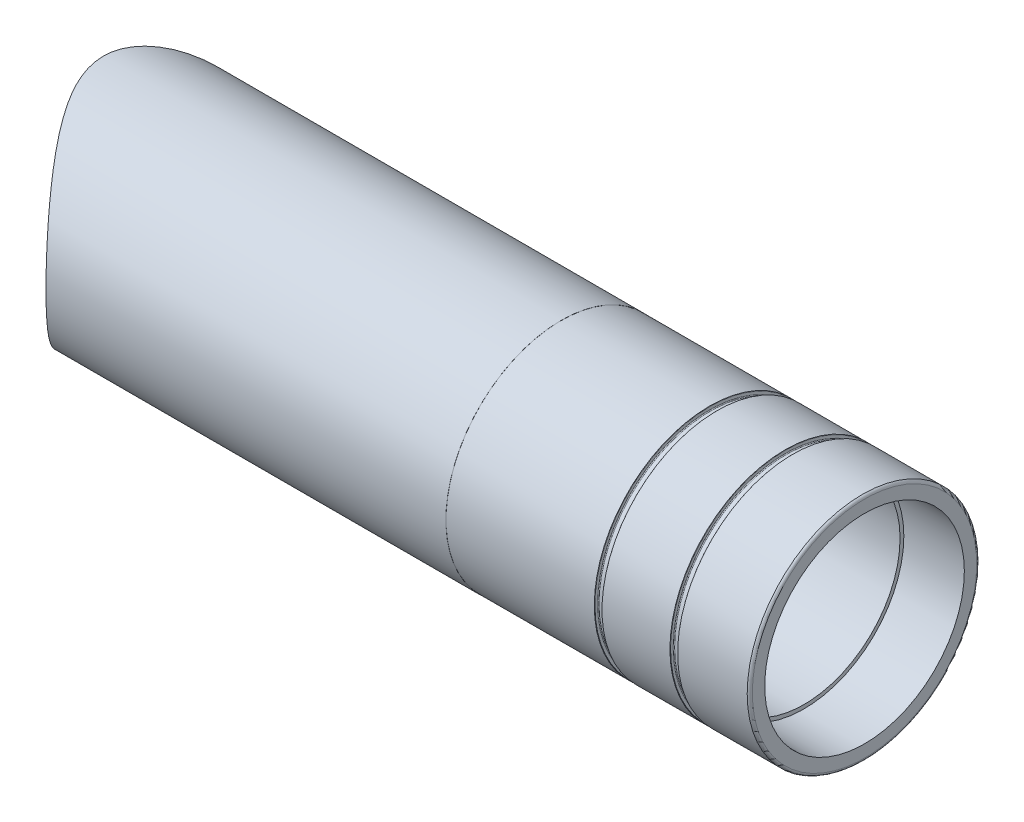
from build123d import *

# Parameters (mm, degrees)
BOSS_EXTRUDE1_DEPTH            = 130
BOSS_EXTRUDE1_DEPTH_BACK       = 150
SKETCH1_R                      = 38.1
SKETCH1_R_2                    = 31.75
CUT_EXTRUDE1_REACH             = 161.384
SKETCH2_R                      = 47.5
CUT_EXTRUDE1_DIRECTION_2_REACH = 161.384
FILLET1_R                      = 1
FILLET2_R                      = 0.1778
SKETCH6_R                      = 33
CUT_EXTRUDE2_DEPTH             = 70
CUT_EXTRUDE4_START             = -20
SKETCH8_R                      = 33
CUT_EXTRUDE4_DEPTH             = 20
SKETCH9_OUTSIDE_W              = 132.948
SKETCH9_OUTSIDE_H              = 132.948
SKETCH9_OUTSIDE_R              = 38.0615
CUT_EXTRUDE5_DEPTH             = 100.3


with BuildPart() as part:
    # Sketch1 → Boss-Extrude1 (new, two sides: drawn at the far end of the back side and taken through both)
    with BuildSketch(Plane(origin=(0, 0, 0), x_dir=(0, 0, -1), z_dir=(1, 0, 0)).offset(-BOSS_EXTRUDE1_DEPTH_BACK)):
        Circle(SKETCH1_R)
        Circle(SKETCH1_R_2, mode=Mode.SUBTRACT)
    extrude(amount=BOSS_EXTRUDE1_DEPTH + BOSS_EXTRUDE1_DEPTH_BACK)

    # Sketch2 → Cut-Extrude1 (cut, up to next)
    with BuildSketch(Plane.XY, mode=Mode.PRIVATE) as cut_extrude1_sk1:
        with Locations((-150, 0)):
            Circle(SKETCH2_R)
    cut_extrude1_tool1 = extrude(cut_extrude1_sk1.sketch, amount=-CUT_EXTRUDE1_REACH, mode=Mode.PRIVATE) & part.part
    add(cut_extrude1_tool1.solids().sort_by_distance((-150, 0, 0))[0], mode=Mode.SUBTRACT)

    # Sketch2 → Cut-Extrude1 direction 2 (cut, up to next)
    with BuildSketch(Plane.XY, mode=Mode.PRIVATE) as cut_extrude1_direction_2_sk1:
        with Locations((-150, 0)):
            Circle(SKETCH2_R)
    cut_extrude1_direction_2_tool1 = extrude(cut_extrude1_direction_2_sk1.sketch, amount=CUT_EXTRUDE1_DIRECTION_2_REACH, mode=Mode.PRIVATE) & part.part
    add(cut_extrude1_direction_2_tool1.solids().sort_by_distance((-150, 0, 0))[0], mode=Mode.SUBTRACT)

    # Fillet1
    fillet1_edges = [part.edges().sort_by_distance(p)[0] for p in [
        (130, 0, 38.1),
    ]]
    fillet(fillet1_edges, radius=FILLET1_R)

    # Sketch5 → Cut-Revolve1 (revolve, cut)
    with BuildSketch(Plane.XY, mode=Mode.PRIVATE) as cut_revolve1_sk:
        with BuildLine():
            Line((103.7935, 39.3825), (106.2065, 39.3825))
            Line((106.2065, 39.3825), (106.2065, 37.0715))
            ThreePointArc((106.2065, 37.0715), (106.132105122, 36.891894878), (105.9525, 36.8175))
            Line((105.9525, 36.8175), (104.0475, 36.8175))
            ThreePointArc((104.0475, 36.8175), (103.867894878, 36.891894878), (103.7935, 37.0715))
            Line((103.7935, 37.0715), (103.7935, 39.3825))
        make_face()
        with BuildLine():
            Line((78.793515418, 39.354735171), (81.206515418, 39.354735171))
            Line((81.206515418, 39.354735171), (81.206515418, 37.043735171))
            ThreePointArc((81.206515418, 37.043735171), (81.13212054, 36.864130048), (80.952515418, 36.789735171))
            Line((80.952515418, 36.789735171), (79.047515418, 36.789735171))
            ThreePointArc((79.047515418, 36.789735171), (78.867910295, 36.864130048), (78.793515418, 37.043735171))
            Line((78.793515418, 37.043735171), (78.793515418, 39.354735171))
        make_face()
    revolve(cut_revolve1_sk.sketch.rotate(Axis((130, 0, 0), (-1, 0, 0)), 90), axis=Axis((130, 0, 0), (-1, 0, 0)), mode=Mode.SUBTRACT)

    # Fillet2
    fillet2_edges = [part.edges().sort_by_distance(p)[0] for p in [
        (103.7935, 0, 38.1),
        (106.2065, 0, 38.1),
        (78.793515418, 0, 38.1),
        (81.206515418, 0, 38.1),
    ]]
    fillet(fillet2_edges, radius=FILLET2_R)

    # Sketch6 → Cut-Extrude2 (cut)
    with BuildSketch(Plane(origin=(-150, 0, 0), x_dir=(0, 0, -1), z_dir=(1, 0, 0))):
        with Locations(Location((0, 0, 0), (0, 0, 180))):
            Circle(SKETCH6_R)
    extrude(amount=CUT_EXTRUDE2_DEPTH, mode=Mode.SUBTRACT)

    # Sketch8 → Cut-Extrude4 (cut)
    with BuildSketch(Plane(origin=(130, 0, 0), x_dir=(0, 0, -1), z_dir=(1, 0, 0)).offset(CUT_EXTRUDE4_START)):
        with Locations(Location((0, 0, 0), (0, 0, 180))):
            Circle(SKETCH8_R)
    extrude(amount=CUT_EXTRUDE4_DEPTH, mode=Mode.SUBTRACT)

    # Sketch9 outside → Cut-Extrude5 (cut)
    with BuildSketch(Plane(origin=(130, 0, 0), x_dir=(0, 0, -1), z_dir=(1, 0, 0))):
        Rectangle(SKETCH9_OUTSIDE_W, SKETCH9_OUTSIDE_H)
        Circle(SKETCH9_OUTSIDE_R, mode=Mode.SUBTRACT)
    extrude(amount=-CUT_EXTRUDE5_DEPTH, mode=Mode.SUBTRACT)


solid = part.part
